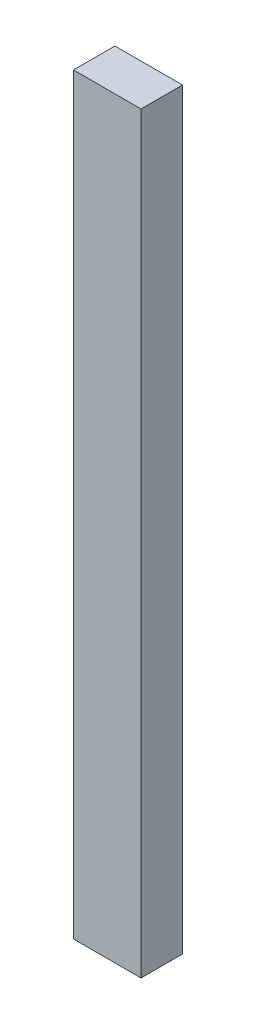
from build123d import *

# Parameters (mm, degrees)
ESQUISSE1_W        = 70
ESQUISSE1_H        = 43
BOSS_EXTRU_1_DEPTH = 780


with BuildPart() as part:
    # Esquisse1 → Boss.-Extru.1 (new body)
    with BuildSketch(Plane(origin=(0, 0, 0), x_dir=(1, 0, 0), z_dir=(0, 1, 0))):
        Rectangle(ESQUISSE1_W, ESQUISSE1_H)
    extrude(amount=BOSS_EXTRU_1_DEPTH)


solid = part.part
